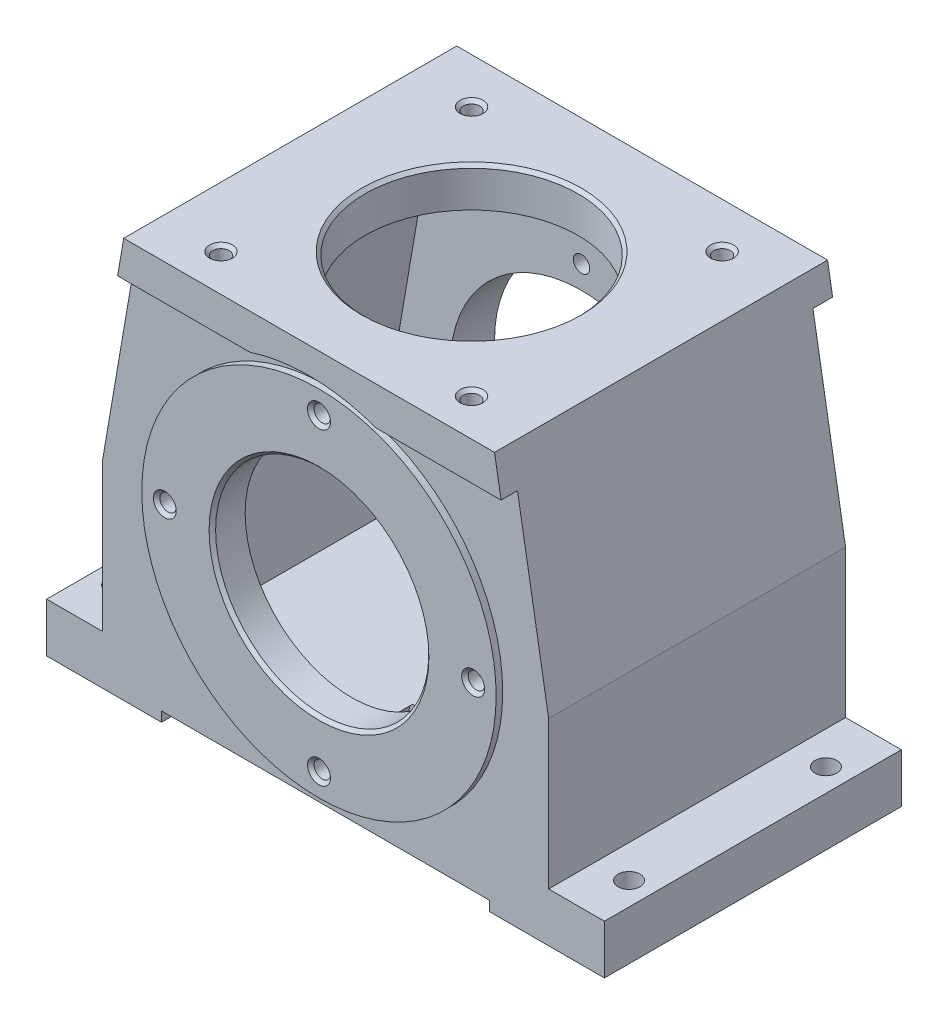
from build123d import *

# Parameters (mm, degrees)
EXTRUSION1_DEPTH                = 44.5
EXTRUSION1_DEPTH_BACK           = 46
ENL_V_MAT_EXTRU_1_DEPTH         = 36.5
ENL_V_MAT_EXTRU_1_DEPTH_BACK    = 33.5
ESQUISSE3_R                     = 54
EXTRUSION2_DEPTH                = 6
EXTRUSION3_START                = 6
ESQUISSE4_R                     = 54
EXTRUSION3_DEPTH                = 6
ESQUISSE5_R                     = 35
ENL_V_MAT_EXTRU_2_DEPTH         = 25
ESQUISSE6_R                     = 27.5
ENL_V_MAT_EXTRU_3_DEPTH         = 25
ESQUISSE14_R                    = 27.5
ENL_V_MAT_EXTRU_9_DEPTH         = 50
EXTRUSION4_DEPTH                = 6
EXTRUSION5_DEPTH                = 5
ESQUISSE10_W                    = 181.509896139
ESQUISSE10_H                    = 107.603370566
ENL_V_MAT_EXTRU_5_DEPTH         = 10
ESQUISSE11_W                    = 134.955946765
ESQUISSE11_H                    = 130.184156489
ENL_V_MAT_EXTRU_6_DEPTH         = 10
ESQUISSE12_R                    = 56.901046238
ENL_V_MAT_EXTRU_7_DEPTH         = 10
ESQUISSE15_R                    = 57.95473251
ENL_V_MAT_EXTRU_10_DEPTH        = 50
ESQUISSE16_R                    = 32.5
ENL_V_MAT_EXTRU_11_DEPTH        = 20
CHANFREIN5_SIZE                 = 1
ESQUISSE17_R                    = 40
ENL_V_MAT_EXTRU_12_DEPTH        = 20
CHANFREIN4_SIZE                 = 1
ESQUISSE18_R                    = 32.5
ENL_V_MAT_EXTRU_13_DEPTH        = 20
CHANFREIN3_SIZE                 = 1
ENL_V_MAT_EXTRU_15_REACH        = 163.425
ESQUISSE19_R                    = 3.35
R_P_TITION_LIN_AIRE2_COUNT      = 2
R_P_TITION_LIN_AIRE2_PITCH      = 156
R_P_TITION_LIN_AIRE2_COUNT_DIR2 = 2
R_P_TITION_LIN_AIRE2_PITCH_DIR2 = 60
CHANFREIN9_SIZE                 = 1
ESQUISSE20_R                    = 2.5
ENL_V_MAT_EXTRU_16_DEPTH        = 30
R_P_TITION_CIRCULAIRE2_COUNT    = 4
CHANFREIN7_SIZE                 = 1
ESQUISSE21_R                    = 2.5
ENL_V_MAT_EXTRU_17_DEPTH        = 20
R_P_TITION_CIRCULAIRE4_COUNT    = 4
CHANFREIN10_SIZE                = 1
ENL_V_START                     = -20
ESQUISSE23_R                    = 2.5
ENL_V_MAT_EXTRU_19_DEPTH        = 20
R_P_TITION_CIRCULAIRE3_COUNT    = 4
CHANFREIN8_SIZE                 = 1


with BuildPart() as part:
    # Esquisse1 → Extrusion1 (new, two sides: drawn at the far end of the back side and taken through both)
    with BuildSketch(Plane.XY.offset(-EXTRUSION1_DEPTH_BACK)):
        Polygon((85, 0), (50, 0), (50, 6), (-50, 6), (-50, 0), (-85, 0), (-85, 18), (-68, 18), (-68, 63), (-56, 133), (56, 133), (68, 63), (68, 18), (85, 18), align=None)
    extrude(amount=EXTRUSION1_DEPTH + EXTRUSION1_DEPTH_BACK)

    # Esquisse2 → Enl_v. mat.-Extru.1 (cut, two sides: drawn at the far end of the back side and taken through both)
    with BuildSketch(Plane.XY.offset(-ENL_V_MAT_EXTRU_1_DEPTH_BACK)):
        Polygon((-46.396378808, 118), (46.396378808, 118), (56, 61.978876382), (56, 17.998876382), (-56, 17.998876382), (-56, 61.978876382), align=None)
    extrude(amount=ENL_V_MAT_EXTRU_1_DEPTH + ENL_V_MAT_EXTRU_1_DEPTH_BACK, mode=Mode.SUBTRACT)

    # Esquisse3 → Extrusion2 (add)
    with BuildSketch(Plane.XY.offset(44.5)):
        with Locations(Location((0, 63, 0), (0, 0, 180))):
            Circle(ESQUISSE3_R)
    extrude(amount=EXTRUSION2_DEPTH)

    # Esquisse4 → Extrusion3 (add)
    with BuildSketch(Plane(origin=(0, 0, -46), x_dir=(-1, 0, 0), z_dir=(0, 0, -1)).offset(EXTRUSION3_START)):
        with Locations((0, 63)):
            Circle(ESQUISSE4_R)
    extrude(amount=-EXTRUSION3_DEPTH)

    # Esquisse5 → Enl_v. mat.-Extru.2 (cut)
    with BuildSketch(Plane(origin=(0, 0, -52), x_dir=(-1, 0, 0), z_dir=(0, 0, -1))):
        with Locations((0, 63)):
            Circle(ESQUISSE5_R)
    extrude(amount=-ENL_V_MAT_EXTRU_2_DEPTH, mode=Mode.SUBTRACT)

    # Esquisse6 → Enl_v. mat.-Extru.3 (cut)
    with BuildSketch(Plane.XY.offset(50.5)):
        with Locations((0, 63)):
            Circle(ESQUISSE6_R)
    extrude(amount=-ENL_V_MAT_EXTRU_3_DEPTH, mode=Mode.SUBTRACT)

    # Esquisse14 → Enl_v. mat.-Extru.9 (cut)
    with BuildSketch(Plane(origin=(0, 88, 0), x_dir=(-1, 0, 0), z_dir=(0, 1, 0))):
        with Locations(Location((0, 0, 0), (0, 0, 180))):
            Circle(ESQUISSE14_R)
    extrude(amount=ENL_V_MAT_EXTRU_9_DEPTH, mode=Mode.SUBTRACT)

    # Esquisse8 → Extrusion4 (add)
    with BuildSketch(Plane(origin=(0, 0, -46), x_dir=(-1, 0, 0), z_dir=(0, 0, -1))):
        with BuildLine():
            Line((-58.057142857, 121), (-14.694133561, 121))
            ThreePointArc((-14.694133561, 121), (0, 122.859100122), (14.694133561, 121))
            Line((14.694133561, 121), (58.057142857, 121))
            Line((58.057142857, 121), (56, 133))
            Line((56, 133), (-56, 133))
            Line((-56, 133), (-58.057142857, 121))
        make_face()
    extrude(amount=EXTRUSION4_DEPTH)

    # Esquisse9 → Extrusion5 (add)
    with BuildSketch(Plane.XY.offset(44.5)):
        with BuildLine():
            Line((-58.37436081, 119.149561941), (-18.117027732, 119.149561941))
            ThreePointArc((-18.117027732, 119.149561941), (1.164475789, 121.988507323), (20.318915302, 118.390808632))
            Line((20.318915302, 118.390808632), (58.504432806, 118.390808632))
            Line((58.504432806, 118.390808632), (56, 133))
            Line((56, 133), (-56, 133))
            Line((-56, 133), (-58.37436081, 119.149561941))
        make_face()
    extrude(amount=EXTRUSION5_DEPTH)

    # Esquisse10 → Enl_v. mat.-Extru.5 (cut)
    with BuildSketch(Plane(origin=(0, 3, 0), x_dir=(-1, 0, 0), z_dir=(0, 1, 0))):
        with Locations((0.141583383, -0.424750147)):
            Rectangle(ESQUISSE10_W, ESQUISSE10_H)
    extrude(amount=-ENL_V_MAT_EXTRU_5_DEPTH, mode=Mode.SUBTRACT)

    # Esquisse11 → Enl_v. mat.-Extru.6 (cut)
    with BuildSketch(Plane(origin=(0, 130, 0), x_dir=(-1, 0, 0), z_dir=(0, 1, 0))):
        with Locations((2.736784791, -4.801878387)):
            Rectangle(ESQUISSE11_W, ESQUISSE11_H)
    enl_v_mat_extru_6 = extrude(amount=ENL_V_MAT_EXTRU_6_DEPTH, mode=Mode.SUBTRACT)

    # Esquisse12 → Enl_v. mat.-Extru.7 (cut)
    with BuildSketch(Plane.XY.offset(-48)):
        with Locations((0, 62.394081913)):
            Circle(ESQUISSE12_R)
    extrude(amount=-ENL_V_MAT_EXTRU_7_DEPTH, mode=Mode.SUBTRACT)

    # Esquisse15 → Enl_v. mat.-Extru.10 (cut)
    with BuildSketch(Plane(origin=(0, 0, 46.5), x_dir=(-1, 0, 0), z_dir=(0, 0, -1))):
        with Locations((0, 63)):
            Circle(ESQUISSE15_R)
    extrude(amount=-ENL_V_MAT_EXTRU_10_DEPTH, mode=Mode.SUBTRACT)

    # Esquisse16 → Enl_v. mat.-Extru.11 (cut)
    with BuildSketch(Plane.XY.offset(46.5)):
        with Locations((0, 63)):
            Circle(ESQUISSE16_R)
    extrude(amount=-ENL_V_MAT_EXTRU_11_DEPTH, mode=Mode.SUBTRACT)

    # Chanfrein5
    chanfrein5_edges = [part.edges().sort_by_distance(p)[0] for p in [
        (-32.5, 63, 46.5),
    ]]
    chamfer(chanfrein5_edges, length=CHANFREIN5_SIZE)

    # Esquisse17 → Enl_v. mat.-Extru.12 (cut)
    with BuildSketch(Plane(origin=(0, 0, -48), x_dir=(-1, 0, 0), z_dir=(0, 0, -1))):
        with Locations((0, 63)):
            Circle(ESQUISSE17_R)
    extrude(amount=-ENL_V_MAT_EXTRU_12_DEPTH, mode=Mode.SUBTRACT)

    # Chanfrein4
    chanfrein4_edges = [part.edges().sort_by_distance(p)[0] for p in [
        (40, 63, -48),
    ]]
    chamfer(chanfrein4_edges, length=CHANFREIN4_SIZE)

    # Esquisse18 → Enl_v. mat.-Extru.13 (cut)
    with BuildSketch(Plane(origin=(0, 130, 0), x_dir=(-1, 0, 0), z_dir=(0, 1, 0))):
        with Locations(Location((0, 0, 0), (0, 0, 90))):
            Circle(ESQUISSE18_R)
    extrude(amount=-ENL_V_MAT_EXTRU_13_DEPTH, mode=Mode.SUBTRACT)

    # Chanfrein3
    chanfrein3_edges = [part.edges().sort_by_distance(p)[0] for p in [
        (0, 130, -32.5),
    ]]
    chamfer(chanfrein3_edges, length=CHANFREIN3_SIZE)

    # Esquisse19 → Enl_v. mat.-Extru.15 (cut, up to next)
    with BuildSketch(Plane.XZ.offset(-3), mode=Mode.PRIVATE) as enl_v_mat_extru_15_sk1:
        with Locations(Location((-78, -30, 0), (0, 0, 270))):
            Circle(ESQUISSE19_R)
    enl_v_mat_extru_15_tool1 = extrude(enl_v_mat_extru_15_sk1.sketch, amount=-ENL_V_MAT_EXTRU_15_REACH, mode=Mode.PRIVATE) & part.part
    enl_v_mat_extru_15 = enl_v_mat_extru_15_tool1.solids().sort_by_distance((-78, 3, -30))[0]
    add(enl_v_mat_extru_15, mode=Mode.SUBTRACT)

    # R_p_tition lin_aire2: Enl_v. mat.-Extru.15 2 × 2
    with Locations(*[(i * R_P_TITION_LIN_AIRE2_PITCH, 0, j * R_P_TITION_LIN_AIRE2_PITCH_DIR2) for i in range(R_P_TITION_LIN_AIRE2_COUNT) for j in range(R_P_TITION_LIN_AIRE2_COUNT_DIR2) if (i, j) != (0, 0)]):
        add(enl_v_mat_extru_15, mode=Mode.SUBTRACT)

    # Chanfrein9
    chanfrein9_edges = [part.edges().sort_by_distance(p)[0] for p in [
        (-78, 3, -26.65),
        (78, 3, -26.65),
        (-78, 3, 33.35),
        (78, 3, 33.35),
    ]]
    chamfer(chanfrein9_edges, length=CHANFREIN9_SIZE)

    # Esquisse20 → Enl_v. mat.-Extru.16 (cut)
    with BuildSketch(Plane.XY.offset(46.5)):
        with Locations((0, 110)):
            Circle(ESQUISSE20_R)
    enl_v_mat_extru_16 = extrude(amount=-ENL_V_MAT_EXTRU_16_DEPTH, mode=Mode.SUBTRACT)

    # R_p_tition circulaire2: Enl_v. mat.-Extru.16 ×4 about axis
    r_p_tition_circulaire2_axis = Axis((0, 63, 0), (0, 0, 1))
    for i in range(1, R_P_TITION_CIRCULAIRE2_COUNT):
        add(enl_v_mat_extru_16.rotate(r_p_tition_circulaire2_axis, i * 360 / R_P_TITION_CIRCULAIRE2_COUNT), mode=Mode.SUBTRACT)

    # Chanfrein7
    chanfrein7_edges = [part.edges().sort_by_distance(p)[0] for p in [
        (-2.5, 110, 46.5),
        (-47, 60.5, 46.5),
        (2.5, 16, 46.5),
        (47, 65.5, 46.5),
    ]]
    chamfer(chanfrein7_edges, length=CHANFREIN7_SIZE)

    # Esquisse21 → Enl_v. mat.-Extru.17 (cut)
    with BuildSketch(Plane(origin=(0, 130, 0), x_dir=(-1, 0, 0), z_dir=(0, 1, 0))):
        with Locations(Location((38.183766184, -38.183766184, 0), (0, 0, 90))):
            Circle(ESQUISSE21_R)
    enl_v_mat_extru_17 = extrude(amount=-ENL_V_MAT_EXTRU_17_DEPTH, mode=Mode.SUBTRACT)

    # R_p_tition circulaire4: Enl_v. mat.-Extru.6, Enl_v. mat.-Extru.17 ×4 about axis
    r_p_tition_circulaire4_axis = Axis((0, 0, 0), (0, 1, 0))
    add([enl_v_mat_extru_6.rotate(r_p_tition_circulaire4_axis, i * 360 / R_P_TITION_CIRCULAIRE4_COUNT) for i in range(1, R_P_TITION_CIRCULAIRE4_COUNT)], mode=Mode.SUBTRACT)
    add([enl_v_mat_extru_17.rotate(r_p_tition_circulaire4_axis, i * 360 / R_P_TITION_CIRCULAIRE4_COUNT) for i in range(1, R_P_TITION_CIRCULAIRE4_COUNT)], mode=Mode.SUBTRACT)

    # Chanfrein10
    chanfrein10_edges = [part.edges().sort_by_distance(p)[0] for p in [
        (-38.183766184, 130, -40.683766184),
        (-40.683766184, 130, 38.183766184),
        (38.183766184, 130, 40.683766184),
        (40.683766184, 130, -38.183766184),
    ]]
    chamfer(chanfrein10_edges, length=CHANFREIN10_SIZE)

    # Esquisse23 → Enl_v. mat.-Extru.19 (cut)
    with BuildSketch(Plane(origin=(0, 0, -48), x_dir=(-1, 0, 0), z_dir=(0, 0, -1)).offset(ENL_V_START)):
        with Locations((0, 110)):
            Circle(ESQUISSE23_R)
    enl_v_mat_extru_19 = extrude(amount=ENL_V_MAT_EXTRU_19_DEPTH, mode=Mode.SUBTRACT)

    # R_p_tition circulaire3: Enl_v. mat.-Extru.19 ×4 about axis
    r_p_tition_circulaire3_axis = Axis((0, 63, 0), (0, 0, 1))
    for i in range(1, R_P_TITION_CIRCULAIRE3_COUNT):
        add(enl_v_mat_extru_19.rotate(r_p_tition_circulaire3_axis, i * 360 / R_P_TITION_CIRCULAIRE3_COUNT), mode=Mode.SUBTRACT)

    # Chanfrein8
    chanfrein8_edges = [part.edges().sort_by_distance(p)[0] for p in [
        (2.5, 110, -48),
        (47, 60.5, -48),
        (-2.5, 16, -48),
        (-47, 65.5, -48),
    ]]
    chamfer(chanfrein8_edges, length=CHANFREIN8_SIZE)


solid = part.part
